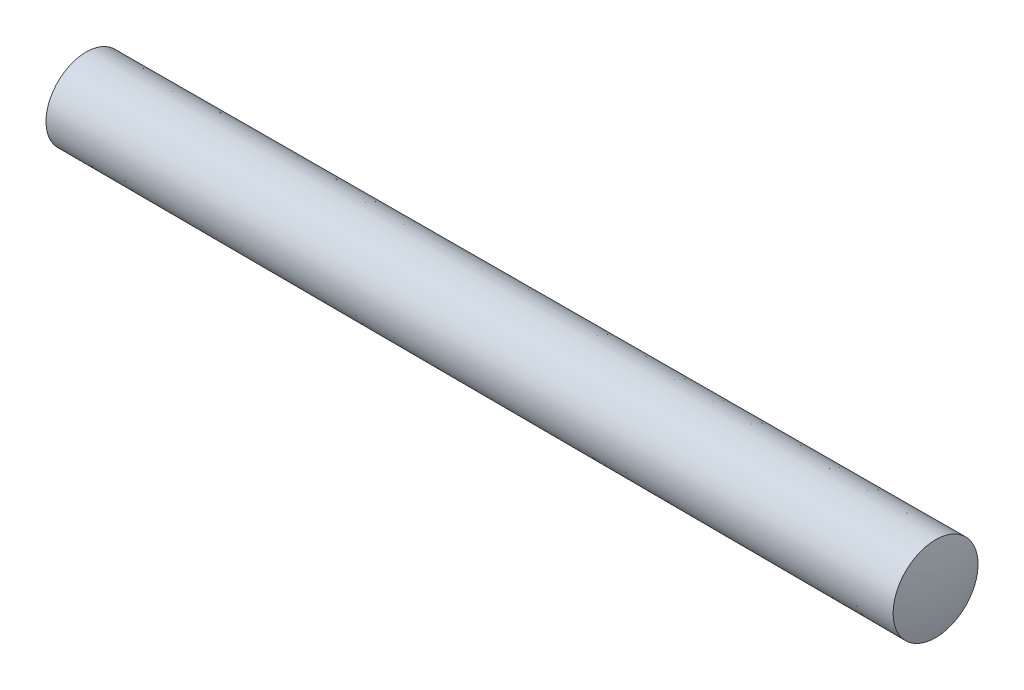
ISO-10303-21;
HEADER;
FILE_DESCRIPTION(('STEP AP214'),'2;1');
FILE_NAME('part.step','',(''),(''),'','','');
FILE_SCHEMA(('AUTOMOTIVE_DESIGN { 1 0 10303 214 1 1 1 1 }'));
ENDSEC;
DATA;
#1=APPLICATION_CONTEXT('core data for automotive mechanical design processes');
#2=APPLICATION_PROTOCOL_DEFINITION('international standard','automotive_design',2000,#1);
#3=PRODUCT_CONTEXT('',#1,'mechanical');
#4=PRODUCT('Part','Part','',(#3));
#5=PRODUCT_RELATED_PRODUCT_CATEGORY('part','',(#4));
#6=PRODUCT_DEFINITION_FORMATION('','',#4);
#7=PRODUCT_DEFINITION_CONTEXT('part definition',#1,'design');
#8=PRODUCT_DEFINITION('design','',#6,#7);
#9=PRODUCT_DEFINITION_SHAPE('','',#8);
#10=(LENGTH_UNIT() NAMED_UNIT(*) SI_UNIT(.MILLI.,.METRE.));
#11=(NAMED_UNIT(*) PLANE_ANGLE_UNIT() SI_UNIT($,.RADIAN.));
#12=(NAMED_UNIT(*) SI_UNIT($,.STERADIAN.) SOLID_ANGLE_UNIT());
#13=UNCERTAINTY_MEASURE_WITH_UNIT(LENGTH_MEASURE(1.E-05),#10,'distance_accuracy_value','');
#14=(GEOMETRIC_REPRESENTATION_CONTEXT(3) GLOBAL_UNCERTAINTY_ASSIGNED_CONTEXT((#13)) GLOBAL_UNIT_ASSIGNED_CONTEXT((#10,
#11,#12)) REPRESENTATION_CONTEXT('',''));
#15=CARTESIAN_POINT('',(0.,0.,0.));
#16=DIRECTION('',(0.,0.,1.));
#17=DIRECTION('',(1.,0.,0.));
#18=AXIS2_PLACEMENT_3D('',#15,#16,#17);
#19=CARTESIAN_POINT('',(12.3382370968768,0.,0.));
#20=DIRECTION('',(-1.,0.,0.));
#21=DIRECTION('',(0.,1.,0.));
#22=AXIS2_PLACEMENT_3D('',#19,#20,#21);
#23=SPHERICAL_SURFACE('',#22,12.7);
#24=CARTESIAN_POINT('',(0.,0.,0.));
#25=DIRECTION('',(-1.,0.,0.));
#26=DIRECTION('',(0.,0.,1.));
#27=AXIS2_PLACEMENT_3D('',#24,#25,#26);
#28=CIRCLE('',#27,3.00963541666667);
#29=CARTESIAN_POINT('',(0.,0.,3.00963541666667));
#30=VERTEX_POINT('',#29);
#31=EDGE_CURVE('E43',#30,#30,#28,.T.);
#32=ORIENTED_EDGE('',*,*,#31,.T.);
#33=EDGE_LOOP('',(#32));
#34=FACE_BOUND('',#33,.T.);
#35=ADVANCED_FACE('F37',(#34),#23,.T.);
#36=CARTESIAN_POINT('',(51.2032778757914,0.,0.));
#37=DIRECTION('',(-1.,0.,0.));
#38=DIRECTION('',(0.,1.,0.));
#39=AXIS2_PLACEMENT_3D('',#36,#37,#38);
#40=SPHERICAL_SURFACE('',#39,12.7);
#41=CARTESIAN_POINT('',(63.5,0.,0.));
#42=DIRECTION('',(-1.,0.,0.));
#43=DIRECTION('',(0.,0.,1.));
#44=AXIS2_PLACEMENT_3D('',#41,#42,#43);
#45=CIRCLE('',#44,3.175);
#46=CARTESIAN_POINT('',(63.5,0.,3.175));
#47=VERTEX_POINT('',#46);
#48=EDGE_CURVE('E10',#47,#47,#45,.T.);
#49=ORIENTED_EDGE('',*,*,#48,.F.);
#50=EDGE_LOOP('',(#49));
#51=FACE_BOUND('',#50,.T.);
#52=ADVANCED_FACE('F52',(#51),#40,.T.);
#53=CARTESIAN_POINT('',(63.5,0.,0.));
#54=DIRECTION('',(1.,0.,0.));
#55=DIRECTION('',(0.,0.,-1.));
#56=AXIS2_PLACEMENT_3D('',#53,#54,#55);
#57=CONICAL_SURFACE('',#56,3.175,0.00260416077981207);
#58=ORIENTED_EDGE('',*,*,#31,.F.);
#59=EDGE_LOOP('',(#58));
#60=FACE_BOUND('',#59,.T.);
#61=ORIENTED_EDGE('',*,*,#48,.T.);
#62=EDGE_LOOP('',(#61));
#63=FACE_BOUND('',#62,.T.);
#64=ADVANCED_FACE('F50',(#60,#63),#57,.T.);
#65=CLOSED_SHELL('',(#35,#52,#64));
#66=MANIFOLD_SOLID_BREP('B2',#65);
#67=ADVANCED_BREP_SHAPE_REPRESENTATION('',(#18,#66),#14);
#68=SHAPE_DEFINITION_REPRESENTATION(#9,#67);
ENDSEC;
END-ISO-10303-21;
